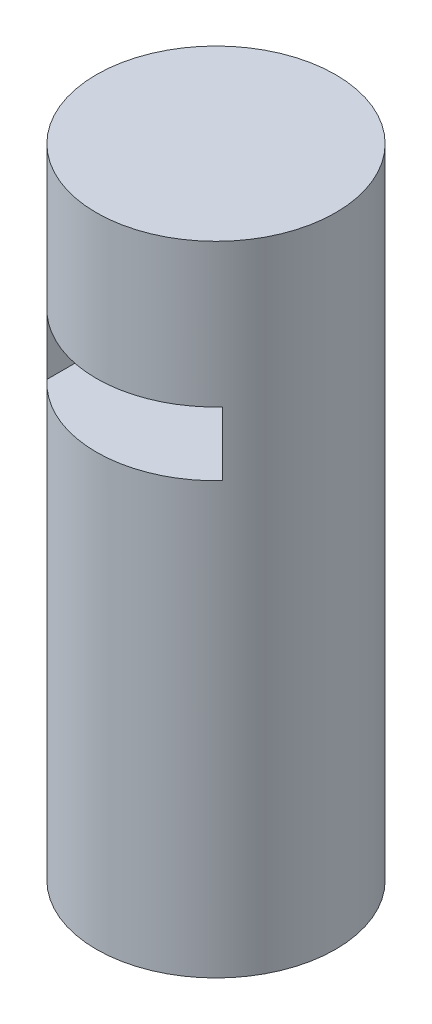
from build123d import *

# Parameters (mm, degrees)
SKETCH1_R           = 9.525
BOSS_EXTRUDE3_DEPTH = 39.37
SKETCH4_W           = 13.97
SKETCH4_H           = 20.32
CUT_EXTRUDE1_DEPTH  = 5.08
SKETCH5_R           = 9.525
BOSS_EXTRUDE4_DEPTH = 11.43


with BuildPart() as part:
    # Sketch1 → Boss-Extrude3 (new body)
    with BuildSketch(Plane(origin=(0, 0, 0), x_dir=(1, 0, 0), z_dir=(0, 1, 0))):
        with Locations(Location((-14.227093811, -3.858194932, 0), (0, 0, 270))):
            Circle(SKETCH1_R)
    extrude(amount=BOSS_EXTRUDE3_DEPTH)

    # Sketch4 → Cut-Extrude1 (cut)
    with BuildSketch(Plane(origin=(0, 39.37, 0), x_dir=(1, 0, 0), z_dir=(0, 1, 0))):
        with Locations((-14.227093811, -3.858194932)):
            Rectangle(SKETCH4_W, SKETCH4_H)
    extrude(amount=-CUT_EXTRUDE1_DEPTH, mode=Mode.SUBTRACT)

    # Sketch5 → Boss-Extrude4 (add)
    with BuildSketch(Plane(origin=(0, 39.37, 0), x_dir=(1, 0, 0), z_dir=(0, 1, 0))):
        with Locations(Location((-14.227093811, -3.858194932, 0), (0, 0, 270))):
            Circle(SKETCH5_R)
    extrude(amount=BOSS_EXTRUDE4_DEPTH)


solid = part.part
